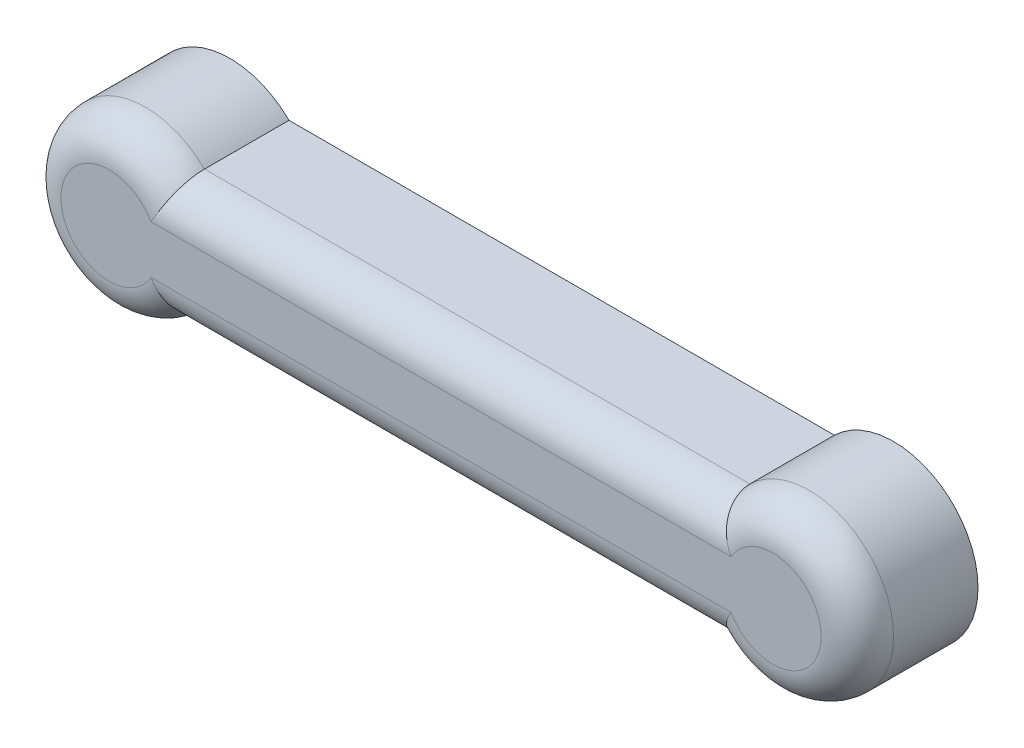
from build123d import *

# Parameters (mm, degrees)
BOSS_EXTRUDE1_DEPTH = 10
SKETCH2_R           = 4.2
CUT_EXTRUDE1_DEPTH  = 8
FILLET1_R           = 3


with BuildPart() as part:
    # Sketch1 → Boss-Extrude1 (new body)
    with BuildSketch(Plane.XY):
        with BuildLine():
            Line((-22.601020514, 5), (22.601020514, 5))
            ThreePointArc((22.601020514, 5), (34.5, 0), (22.601020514, -5))
            Line((22.601020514, -5), (-22.601020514, -5))
            ThreePointArc((-22.601020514, -5), (-34.5, 0), (-22.601020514, 5))
        make_face()
    extrude(amount=BOSS_EXTRUDE1_DEPTH)

    # Sketch2 → Cut-Extrude1 (cut)
    with BuildSketch(Plane(origin=(0, 0, 0), x_dir=(-1, 0, 0), z_dir=(0, 0, -1))):
        with Locations((-27.5, 0)):
            Circle(SKETCH2_R)
        with Locations((27.5, 0)):
            Circle(SKETCH2_R)
    extrude(amount=-CUT_EXTRUDE1_DEPTH, mode=Mode.SUBTRACT)

    # Fillet1
    fillet1_edges = [part.edges().sort_by_distance(p)[0] for p in [
        (34.5, 0, 10),
        (0, 5, 10),
        (-34.5, 0, 10),
        (0, -5, 10),
    ]]
    fillet(fillet1_edges, radius=FILLET1_R)


solid = part.part
